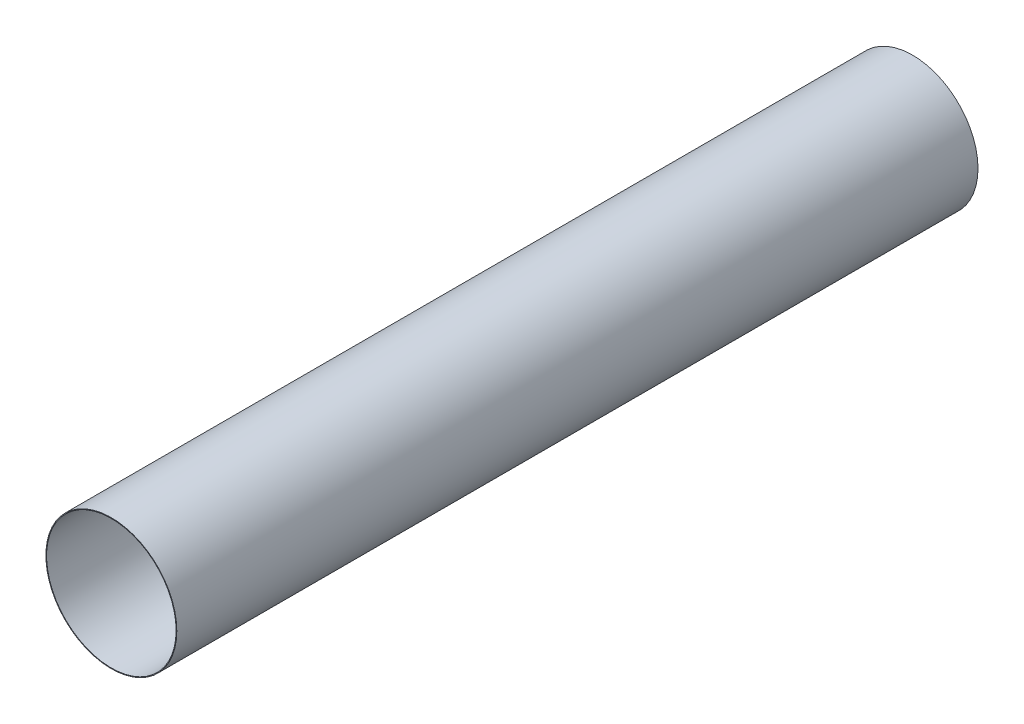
ISO-10303-21;
HEADER;
FILE_DESCRIPTION(('STEP AP214'),'2;1');
FILE_NAME('part.step','',(''),(''),'','','');
FILE_SCHEMA(('AUTOMOTIVE_DESIGN { 1 0 10303 214 1 1 1 1 }'));
ENDSEC;
DATA;
#1=APPLICATION_CONTEXT('core data for automotive mechanical design processes');
#2=APPLICATION_PROTOCOL_DEFINITION('international standard','automotive_design',2000,#1);
#3=PRODUCT_CONTEXT('',#1,'mechanical');
#4=PRODUCT('Part','Part','',(#3));
#5=PRODUCT_RELATED_PRODUCT_CATEGORY('part','',(#4));
#6=PRODUCT_DEFINITION_FORMATION('','',#4);
#7=PRODUCT_DEFINITION_CONTEXT('part definition',#1,'design');
#8=PRODUCT_DEFINITION('design','',#6,#7);
#9=PRODUCT_DEFINITION_SHAPE('','',#8);
#10=(LENGTH_UNIT() NAMED_UNIT(*) SI_UNIT(.MILLI.,.METRE.));
#11=(NAMED_UNIT(*) PLANE_ANGLE_UNIT() SI_UNIT($,.RADIAN.));
#12=(NAMED_UNIT(*) SI_UNIT($,.STERADIAN.) SOLID_ANGLE_UNIT());
#13=UNCERTAINTY_MEASURE_WITH_UNIT(LENGTH_MEASURE(1.E-05),#10,'distance_accuracy_value','');
#14=(GEOMETRIC_REPRESENTATION_CONTEXT(3) GLOBAL_UNCERTAINTY_ASSIGNED_CONTEXT((#13)) GLOBAL_UNIT_ASSIGNED_CONTEXT((#10,
#11,#12)) REPRESENTATION_CONTEXT('',''));
#15=CARTESIAN_POINT('',(0.,0.,0.));
#16=DIRECTION('',(0.,0.,1.));
#17=DIRECTION('',(1.,0.,0.));
#18=AXIS2_PLACEMENT_3D('',#15,#16,#17);
#19=CARTESIAN_POINT('',(0.,0.,-235.));
#20=DIRECTION('',(0.,0.,1.));
#21=DIRECTION('',(1.,0.,0.));
#22=AXIS2_PLACEMENT_3D('',#19,#20,#21);
#23=CYLINDRICAL_SURFACE('',#22,19.2);
#24=CARTESIAN_POINT('',(0.,0.,-235.));
#25=DIRECTION('',(0.,0.,1.));
#26=DIRECTION('',(1.,0.,0.));
#27=AXIS2_PLACEMENT_3D('',#24,#25,#26);
#28=CIRCLE('',#27,19.2);
#29=CARTESIAN_POINT('',(19.2,0.,-235.));
#30=VERTEX_POINT('',#29);
#31=EDGE_CURVE('E10',#30,#30,#28,.T.);
#32=CARTESIAN_POINT('',(0.,0.,0.));
#33=DIRECTION('',(0.,0.,1.));
#34=DIRECTION('',(1.,0.,0.));
#35=AXIS2_PLACEMENT_3D('',#32,#33,#34);
#36=CIRCLE('',#35,19.2);
#37=CARTESIAN_POINT('',(19.2,0.,0.));
#38=VERTEX_POINT('',#37);
#39=EDGE_CURVE('E37',#38,#38,#36,.T.);
#40=CARTESIAN_POINT('',(19.2,0.,-235.));
#41=CARTESIAN_POINT('',(19.2,0.,-232.552083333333));
#42=CARTESIAN_POINT('',(19.2,0.,-230.104166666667));
#43=CARTESIAN_POINT('',(19.2,0.,-225.208333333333));
#44=CARTESIAN_POINT('',(19.2,0.,-222.760416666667));
#45=CARTESIAN_POINT('',(19.2,0.,-217.864583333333));
#46=CARTESIAN_POINT('',(19.2,0.,-215.416666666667));
#47=CARTESIAN_POINT('',(19.2,0.,-210.520833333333));
#48=CARTESIAN_POINT('',(19.2,0.,-208.072916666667));
#49=CARTESIAN_POINT('',(19.2,0.,-203.177083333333));
#50=CARTESIAN_POINT('',(19.2,0.,-200.729166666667));
#51=CARTESIAN_POINT('',(19.2,0.,-195.833333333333));
#52=CARTESIAN_POINT('',(19.2,0.,-193.385416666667));
#53=CARTESIAN_POINT('',(19.2,0.,-188.489583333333));
#54=CARTESIAN_POINT('',(19.2,0.,-186.041666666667));
#55=CARTESIAN_POINT('',(19.2,0.,-181.145833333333));
#56=CARTESIAN_POINT('',(19.2,0.,-178.697916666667));
#57=CARTESIAN_POINT('',(19.2,0.,-173.802083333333));
#58=CARTESIAN_POINT('',(19.2,0.,-171.354166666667));
#59=CARTESIAN_POINT('',(19.2,0.,-166.458333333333));
#60=CARTESIAN_POINT('',(19.2,0.,-164.010416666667));
#61=CARTESIAN_POINT('',(19.2,0.,-159.114583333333));
#62=CARTESIAN_POINT('',(19.2,0.,-156.666666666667));
#63=CARTESIAN_POINT('',(19.2,0.,-151.770833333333));
#64=CARTESIAN_POINT('',(19.2,0.,-149.322916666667));
#65=CARTESIAN_POINT('',(19.2,0.,-144.427083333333));
#66=CARTESIAN_POINT('',(19.2,0.,-141.979166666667));
#67=CARTESIAN_POINT('',(19.2,0.,-137.083333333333));
#68=CARTESIAN_POINT('',(19.2,0.,-134.635416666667));
#69=CARTESIAN_POINT('',(19.2,0.,-129.739583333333));
#70=CARTESIAN_POINT('',(19.2,0.,-127.291666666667));
#71=CARTESIAN_POINT('',(19.2,0.,-122.395833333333));
#72=CARTESIAN_POINT('',(19.2,0.,-119.947916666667));
#73=CARTESIAN_POINT('',(19.2,0.,-115.052083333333));
#74=CARTESIAN_POINT('',(19.2,0.,-112.604166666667));
#75=CARTESIAN_POINT('',(19.2,0.,-107.708333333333));
#76=CARTESIAN_POINT('',(19.2,0.,-105.260416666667));
#77=CARTESIAN_POINT('',(19.2,0.,-100.364583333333));
#78=CARTESIAN_POINT('',(19.2,0.,-97.9166666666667));
#79=CARTESIAN_POINT('',(19.2,0.,-93.0208333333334));
#80=CARTESIAN_POINT('',(19.2,0.,-90.5729166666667));
#81=CARTESIAN_POINT('',(19.2,0.,-85.6770833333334));
#82=CARTESIAN_POINT('',(19.2,0.,-83.2291666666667));
#83=CARTESIAN_POINT('',(19.2,0.,-78.3333333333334));
#84=CARTESIAN_POINT('',(19.2,0.,-75.8854166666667));
#85=CARTESIAN_POINT('',(19.2,0.,-70.9895833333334));
#86=CARTESIAN_POINT('',(19.2,0.,-68.5416666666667));
#87=CARTESIAN_POINT('',(19.2,0.,-63.6458333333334));
#88=CARTESIAN_POINT('',(19.2,0.,-61.1979166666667));
#89=CARTESIAN_POINT('',(19.2,0.,-56.3020833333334));
#90=CARTESIAN_POINT('',(19.2,0.,-53.8541666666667));
#91=CARTESIAN_POINT('',(19.2,0.,-48.9583333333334));
#92=CARTESIAN_POINT('',(19.2,0.,-46.5104166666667));
#93=CARTESIAN_POINT('',(19.2,0.,-41.6145833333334));
#94=CARTESIAN_POINT('',(19.2,0.,-39.1666666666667));
#95=CARTESIAN_POINT('',(19.2,0.,-34.2708333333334));
#96=CARTESIAN_POINT('',(19.2,0.,-31.8229166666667));
#97=CARTESIAN_POINT('',(19.2,0.,-26.9270833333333));
#98=CARTESIAN_POINT('',(19.2,0.,-24.4791666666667));
#99=CARTESIAN_POINT('',(19.2,0.,-19.5833333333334));
#100=CARTESIAN_POINT('',(19.2,0.,-17.1354166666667));
#101=CARTESIAN_POINT('',(19.2,0.,-12.2395833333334));
#102=CARTESIAN_POINT('',(19.2,0.,-9.7916666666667));
#103=CARTESIAN_POINT('',(19.2,0.,-4.89583333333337));
#104=CARTESIAN_POINT('',(19.2,0.,-2.4479166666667));
#105=CARTESIAN_POINT('',(19.2,0.,0.));
#106=B_SPLINE_CURVE_WITH_KNOTS('',3,(#40,#41,#42,#43,#44,#45,#46,#47,#48,#49,#50,#51,#52,#53,
#54,#55,#56,#57,#58,#59,#60,#61,#62,#63,#64,#65,#66,#67,#68,#69,#70,#71,#72,#73,#74,#75,#76,#77,
#78,#79,#80,#81,#82,#83,#84,#85,#86,#87,#88,#89,#90,#91,#92,#93,#94,#95,#96,#97,#98,#99,#100,
#101,#102,#103,#104,#105),.UNSPECIFIED.,.F.,.F.,(4,2,2,2,2,2,2,2,2,2,2,2,2,2,2,2,2,2,2,2,2,2,2,
2,2,2,2,2,2,2,2,2,4),(0.,7.34374999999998,14.6875,22.03125,29.375,36.71875,44.0625,51.40625,
58.75,66.09375,73.4375,80.78125,88.125,95.46875,102.8125,110.15625,117.5,124.84375,132.1875,
139.53125,146.875,154.21875,161.5625,168.90625,176.25,183.59375,190.9375,198.28125,205.625,
212.96875,220.3125,227.65625,235.),.UNSPECIFIED.);
#107=EDGE_CURVE('BSEAM34',#30,#38,#106,.T.);
#108=ORIENTED_EDGE('',*,*,#31,.T.);
#109=ORIENTED_EDGE('',*,*,#39,.F.);
#110=ORIENTED_EDGE('',*,*,#107,.T.);
#111=ORIENTED_EDGE('',*,*,#107,.F.);
#112=EDGE_LOOP('',(#108,#110,#109,#111));
#113=FACE_BOUND('',#112,.T.);
#114=ADVANCED_FACE('F34',(#113),#23,.T.);
#115=CARTESIAN_POINT('',(0.,0.,-235.));
#116=DIRECTION('',(0.,0.,1.));
#117=DIRECTION('',(1.,0.,0.));
#118=AXIS2_PLACEMENT_3D('',#115,#116,#117);
#119=PLANE('',#118);
#120=CARTESIAN_POINT('',(0.,0.,-235.));
#121=DIRECTION('',(0.,0.,1.));
#122=DIRECTION('',(1.,0.,0.));
#123=AXIS2_PLACEMENT_3D('',#120,#121,#122);
#124=CIRCLE('',#123,19.);
#125=CARTESIAN_POINT('',(19.,0.,-235.));
#126=VERTEX_POINT('',#125);
#127=EDGE_CURVE('E44',#126,#126,#124,.T.);
#128=ORIENTED_EDGE('',*,*,#127,.T.);
#129=EDGE_LOOP('',(#128));
#130=FACE_BOUND('',#129,.T.);
#131=ORIENTED_EDGE('',*,*,#31,.F.);
#132=EDGE_LOOP('',(#131));
#133=FACE_BOUND('',#132,.T.);
#134=ADVANCED_FACE('F52',(#130,#133),#119,.F.);
#135=CARTESIAN_POINT('',(0.,0.,0.));
#136=DIRECTION('',(0.,0.,1.));
#137=DIRECTION('',(1.,0.,0.));
#138=AXIS2_PLACEMENT_3D('',#135,#136,#137);
#139=PLANE('',#138);
#140=CARTESIAN_POINT('',(0.,0.,0.));
#141=DIRECTION('',(0.,0.,1.));
#142=DIRECTION('',(1.,0.,0.));
#143=AXIS2_PLACEMENT_3D('',#140,#141,#142);
#144=CIRCLE('',#143,19.);
#145=CARTESIAN_POINT('',(19.,0.,0.));
#146=VERTEX_POINT('',#145);
#147=EDGE_CURVE('E46',#146,#146,#144,.T.);
#148=ORIENTED_EDGE('',*,*,#147,.F.);
#149=EDGE_LOOP('',(#148));
#150=FACE_BOUND('',#149,.T.);
#151=ORIENTED_EDGE('',*,*,#39,.T.);
#152=EDGE_LOOP('',(#151));
#153=FACE_BOUND('',#152,.T.);
#154=ADVANCED_FACE('F58',(#150,#153),#139,.T.);
#155=CARTESIAN_POINT('',(0.,0.,-235.));
#156=DIRECTION('',(0.,0.,1.));
#157=DIRECTION('',(1.,0.,0.));
#158=AXIS2_PLACEMENT_3D('',#155,#156,#157);
#159=CYLINDRICAL_SURFACE('',#158,19.);
#160=CARTESIAN_POINT('',(19.,0.,-235.));
#161=CARTESIAN_POINT('',(19.,0.,-232.552083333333));
#162=CARTESIAN_POINT('',(19.,0.,-230.104166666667));
#163=CARTESIAN_POINT('',(19.,0.,-225.208333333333));
#164=CARTESIAN_POINT('',(19.,0.,-222.760416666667));
#165=CARTESIAN_POINT('',(19.,0.,-217.864583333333));
#166=CARTESIAN_POINT('',(19.,0.,-215.416666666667));
#167=CARTESIAN_POINT('',(19.,0.,-210.520833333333));
#168=CARTESIAN_POINT('',(19.,0.,-208.072916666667));
#169=CARTESIAN_POINT('',(19.,0.,-203.177083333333));
#170=CARTESIAN_POINT('',(19.,0.,-200.729166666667));
#171=CARTESIAN_POINT('',(19.,0.,-195.833333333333));
#172=CARTESIAN_POINT('',(19.,0.,-193.385416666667));
#173=CARTESIAN_POINT('',(19.,0.,-188.489583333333));
#174=CARTESIAN_POINT('',(19.,0.,-186.041666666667));
#175=CARTESIAN_POINT('',(19.,0.,-181.145833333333));
#176=CARTESIAN_POINT('',(19.,0.,-178.697916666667));
#177=CARTESIAN_POINT('',(19.,0.,-173.802083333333));
#178=CARTESIAN_POINT('',(19.,0.,-171.354166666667));
#179=CARTESIAN_POINT('',(19.,0.,-166.458333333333));
#180=CARTESIAN_POINT('',(19.,0.,-164.010416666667));
#181=CARTESIAN_POINT('',(19.,0.,-159.114583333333));
#182=CARTESIAN_POINT('',(19.,0.,-156.666666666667));
#183=CARTESIAN_POINT('',(19.,0.,-151.770833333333));
#184=CARTESIAN_POINT('',(19.,0.,-149.322916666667));
#185=CARTESIAN_POINT('',(19.,0.,-144.427083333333));
#186=CARTESIAN_POINT('',(19.,0.,-141.979166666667));
#187=CARTESIAN_POINT('',(19.,0.,-137.083333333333));
#188=CARTESIAN_POINT('',(19.,0.,-134.635416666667));
#189=CARTESIAN_POINT('',(19.,0.,-129.739583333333));
#190=CARTESIAN_POINT('',(19.,0.,-127.291666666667));
#191=CARTESIAN_POINT('',(19.,0.,-122.395833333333));
#192=CARTESIAN_POINT('',(19.,0.,-119.947916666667));
#193=CARTESIAN_POINT('',(19.,0.,-115.052083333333));
#194=CARTESIAN_POINT('',(19.,0.,-112.604166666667));
#195=CARTESIAN_POINT('',(19.,0.,-107.708333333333));
#196=CARTESIAN_POINT('',(19.,0.,-105.260416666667));
#197=CARTESIAN_POINT('',(19.,0.,-100.364583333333));
#198=CARTESIAN_POINT('',(19.,0.,-97.9166666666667));
#199=CARTESIAN_POINT('',(19.,0.,-93.0208333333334));
#200=CARTESIAN_POINT('',(19.,0.,-90.5729166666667));
#201=CARTESIAN_POINT('',(19.,0.,-85.6770833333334));
#202=CARTESIAN_POINT('',(19.,0.,-83.2291666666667));
#203=CARTESIAN_POINT('',(19.,0.,-78.3333333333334));
#204=CARTESIAN_POINT('',(19.,0.,-75.8854166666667));
#205=CARTESIAN_POINT('',(19.,0.,-70.9895833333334));
#206=CARTESIAN_POINT('',(19.,0.,-68.5416666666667));
#207=CARTESIAN_POINT('',(19.,0.,-63.6458333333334));
#208=CARTESIAN_POINT('',(19.,0.,-61.1979166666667));
#209=CARTESIAN_POINT('',(19.,0.,-56.3020833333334));
#210=CARTESIAN_POINT('',(19.,0.,-53.8541666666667));
#211=CARTESIAN_POINT('',(19.,0.,-48.9583333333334));
#212=CARTESIAN_POINT('',(19.,0.,-46.5104166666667));
#213=CARTESIAN_POINT('',(19.,0.,-41.6145833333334));
#214=CARTESIAN_POINT('',(19.,0.,-39.1666666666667));
#215=CARTESIAN_POINT('',(19.,0.,-34.2708333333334));
#216=CARTESIAN_POINT('',(19.,0.,-31.8229166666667));
#217=CARTESIAN_POINT('',(19.,0.,-26.9270833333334));
#218=CARTESIAN_POINT('',(19.,0.,-24.4791666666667));
#219=CARTESIAN_POINT('',(19.,0.,-19.5833333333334));
#220=CARTESIAN_POINT('',(19.,0.,-17.1354166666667));
#221=CARTESIAN_POINT('',(19.,0.,-12.2395833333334));
#222=CARTESIAN_POINT('',(19.,0.,-9.7916666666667));
#223=CARTESIAN_POINT('',(19.,0.,-4.89583333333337));
#224=CARTESIAN_POINT('',(19.,0.,-2.4479166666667));
#225=CARTESIAN_POINT('',(19.,0.,0.));
#226=B_SPLINE_CURVE_WITH_KNOTS('',3,(#160,#161,#162,#163,#164,#165,#166,#167,#168,#169,#170,
#171,#172,#173,#174,#175,#176,#177,#178,#179,#180,#181,#182,#183,#184,#185,#186,#187,#188,#189,
#190,#191,#192,#193,#194,#195,#196,#197,#198,#199,#200,#201,#202,#203,#204,#205,#206,#207,#208,
#209,#210,#211,#212,#213,#214,#215,#216,#217,#218,#219,#220,#221,#222,#223,#224,#225),
.UNSPECIFIED.,.F.,.F.,(4,2,2,2,2,2,2,2,2,2,2,2,2,2,2,2,2,2,2,2,2,2,2,2,2,2,2,2,2,2,2,2,4),(0.,
7.34375000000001,14.6875,22.03125,29.375,36.71875,44.0625,51.40625,58.75,66.09375,73.4375,
80.78125,88.125,95.46875,102.8125,110.15625,117.5,124.84375,132.1875,139.53125,146.875,
154.21875,161.5625,168.90625,176.25,183.59375,190.9375,198.28125,205.625,212.96875,220.3125,
227.65625,235.),.UNSPECIFIED.);
#227=EDGE_CURVE('BSEAM55',#126,#146,#226,.T.);
#228=ORIENTED_EDGE('',*,*,#127,.F.);
#229=ORIENTED_EDGE('',*,*,#147,.T.);
#230=ORIENTED_EDGE('',*,*,#227,.T.);
#231=ORIENTED_EDGE('',*,*,#227,.F.);
#232=EDGE_LOOP('',(#228,#230,#229,#231));
#233=FACE_BOUND('',#232,.T.);
#234=ADVANCED_FACE('F55',(#233),#159,.F.);
#235=CLOSED_SHELL('',(#114,#134,#154,#234));
#236=MANIFOLD_SOLID_BREP('B2',#235);
#237=ADVANCED_BREP_SHAPE_REPRESENTATION('',(#18,#236),#14);
#238=SHAPE_DEFINITION_REPRESENTATION(#9,#237);
ENDSEC;
END-ISO-10303-21;
